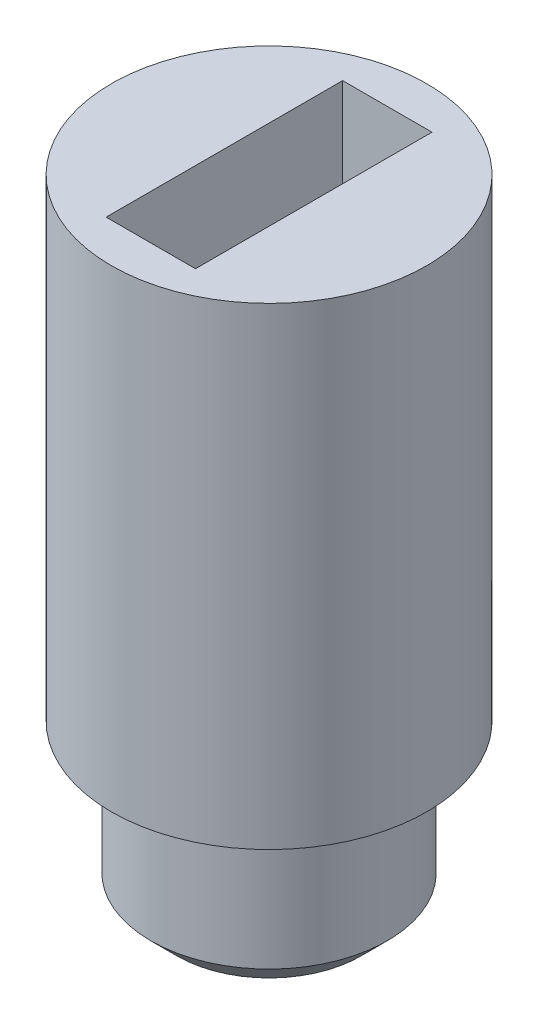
from build123d import *

# Parameters (mm, degrees)
SKETCH2_W          = 1.7
SKETCH2_H          = 4.5
CUT_EXTRUDE1_DEPTH = 2
CHAMFER1_SIZE      = 0.5


with BuildPart() as part:
    # Sketch1 → Revolve1 (revolve)
    with BuildSketch(Plane(origin=(0, 0, 0), x_dir=(0, 0, -1), z_dir=(1, 0, 0)), mode=Mode.PRIVATE) as revolve1_sk:
        Polygon((0, 0), (0, 12), (3, 12), (3, 3), (2.25, 3), (2.25, 0), align=None)
    revolve(revolve1_sk.sketch.rotate(Axis((0, 0, 0), (0, -1, 0)), 180), axis=Axis((0, 0, 0), (0, -1, 0)))

    # Sketch2 → Cut-Extrude1 (cut)
    with BuildSketch(Plane(origin=(0, 12, 0), x_dir=(1, 0, 0), z_dir=(0, 1, 0))):
        Rectangle(SKETCH2_W, SKETCH2_H)
    extrude(amount=-CUT_EXTRUDE1_DEPTH, mode=Mode.SUBTRACT)

    # Chamfer1
    chamfer1_edges = [part.edges().sort_by_distance(p)[0] for p in [
        (0, 0, -2.25),
    ]]
    chamfer(chamfer1_edges, length=CHAMFER1_SIZE)


solid = part.part
